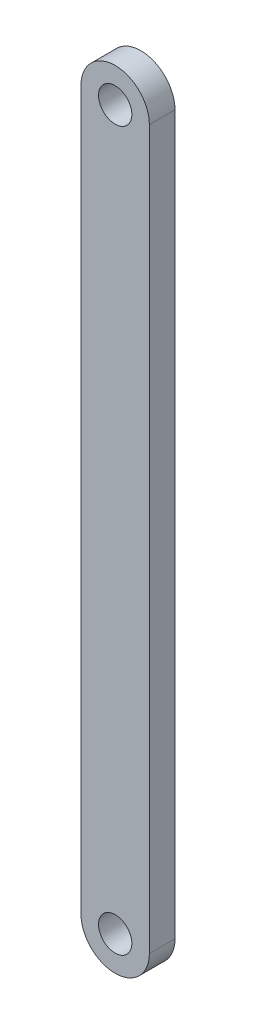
ISO-10303-21;
HEADER;
FILE_DESCRIPTION(('STEP AP214'),'2;1');
FILE_NAME('part.step','',(''),(''),'','','');
FILE_SCHEMA(('AUTOMOTIVE_DESIGN { 1 0 10303 214 1 1 1 1 }'));
ENDSEC;
DATA;
#1=APPLICATION_CONTEXT('core data for automotive mechanical design processes');
#2=APPLICATION_PROTOCOL_DEFINITION('international standard','automotive_design',2000,#1);
#3=PRODUCT_CONTEXT('',#1,'mechanical');
#4=PRODUCT('Part','Part','',(#3));
#5=PRODUCT_RELATED_PRODUCT_CATEGORY('part','',(#4));
#6=PRODUCT_DEFINITION_FORMATION('','',#4);
#7=PRODUCT_DEFINITION_CONTEXT('part definition',#1,'design');
#8=PRODUCT_DEFINITION('design','',#6,#7);
#9=PRODUCT_DEFINITION_SHAPE('','',#8);
#10=(LENGTH_UNIT() NAMED_UNIT(*) SI_UNIT(.MILLI.,.METRE.));
#11=(NAMED_UNIT(*) PLANE_ANGLE_UNIT() SI_UNIT($,.RADIAN.));
#12=(NAMED_UNIT(*) SI_UNIT($,.STERADIAN.) SOLID_ANGLE_UNIT());
#13=UNCERTAINTY_MEASURE_WITH_UNIT(LENGTH_MEASURE(1.E-05),#10,'distance_accuracy_value','');
#14=(GEOMETRIC_REPRESENTATION_CONTEXT(3) GLOBAL_UNCERTAINTY_ASSIGNED_CONTEXT((#13)) GLOBAL_UNIT_ASSIGNED_CONTEXT((#10,
#11,#12)) REPRESENTATION_CONTEXT('',''));
#15=CARTESIAN_POINT('',(0.,0.,0.));
#16=DIRECTION('',(0.,0.,1.));
#17=DIRECTION('',(1.,0.,0.));
#18=AXIS2_PLACEMENT_3D('',#15,#16,#17);
#19=CARTESIAN_POINT('',(0.,0.,3.));
#20=DIRECTION('',(0.,0.,-1.));
#21=DIRECTION('',(-1.,0.,0.));
#22=AXIS2_PLACEMENT_3D('',#19,#20,#21);
#23=CYLINDRICAL_SURFACE('',#22,4.);
#24=CARTESIAN_POINT('',(0.,0.,0.));
#25=DIRECTION('',(0.,0.,1.));
#26=DIRECTION('',(1.,0.,0.));
#27=AXIS2_PLACEMENT_3D('',#24,#25,#26);
#28=CIRCLE('',#27,4.);
#29=CARTESIAN_POINT('',(-4.,0.,0.));
#30=VERTEX_POINT('',#29);
#31=CARTESIAN_POINT('',(4.,0.,0.));
#32=VERTEX_POINT('',#31);
#33=EDGE_CURVE('E98',#30,#32,#28,.T.);
#34=ORIENTED_EDGE('',*,*,#33,.T.);
#35=DIRECTION('',(0.,0.,-1.));
#36=VECTOR('',#35,1.);
#37=CARTESIAN_POINT('',(4.,0.,3.));
#38=LINE('',#37,#36);
#39=CARTESIAN_POINT('',(4.,0.,3.));
#40=VERTEX_POINT('',#39);
#41=EDGE_CURVE('E11',#40,#32,#38,.T.);
#42=ORIENTED_EDGE('',*,*,#41,.F.);
#43=CARTESIAN_POINT('',(0.,0.,3.));
#44=DIRECTION('',(0.,0.,1.));
#45=DIRECTION('',(1.,0.,0.));
#46=AXIS2_PLACEMENT_3D('',#43,#44,#45);
#47=CIRCLE('',#46,4.);
#48=CARTESIAN_POINT('',(-4.,0.,3.));
#49=VERTEX_POINT('',#48);
#50=EDGE_CURVE('E86',#49,#40,#47,.T.);
#51=ORIENTED_EDGE('',*,*,#50,.F.);
#52=DIRECTION('',(0.,0.,-1.));
#53=VECTOR('',#52,1.);
#54=CARTESIAN_POINT('',(-4.,0.,3.));
#55=LINE('',#54,#53);
#56=EDGE_CURVE('E94',#49,#30,#55,.T.);
#57=ORIENTED_EDGE('',*,*,#56,.T.);
#58=EDGE_LOOP('',(#34,#42,#51,#57));
#59=FACE_BOUND('',#58,.T.);
#60=ADVANCED_FACE('F35',(#59),#23,.T.);
#61=CARTESIAN_POINT('',(4.,0.,3.));
#62=DIRECTION('',(-1.,0.,0.));
#63=DIRECTION('',(0.,0.,1.));
#64=AXIS2_PLACEMENT_3D('',#61,#62,#63);
#65=PLANE('',#64);
#66=DIRECTION('',(0.,1.,0.));
#67=VECTOR('',#66,1.);
#68=CARTESIAN_POINT('',(4.,0.,0.));
#69=LINE('',#68,#67);
#70=CARTESIAN_POINT('',(4.,84.,0.));
#71=VERTEX_POINT('',#70);
#72=EDGE_CURVE('E90',#32,#71,#69,.T.);
#73=ORIENTED_EDGE('',*,*,#72,.T.);
#74=DIRECTION('',(0.,0.,-1.));
#75=VECTOR('',#74,1.);
#76=CARTESIAN_POINT('',(4.,84.,3.));
#77=LINE('',#76,#75);
#78=CARTESIAN_POINT('',(4.,84.,3.));
#79=VERTEX_POINT('',#78);
#80=EDGE_CURVE('E43',#79,#71,#77,.T.);
#81=ORIENTED_EDGE('',*,*,#80,.F.);
#82=DIRECTION('',(0.,1.,0.));
#83=VECTOR('',#82,1.);
#84=CARTESIAN_POINT('',(4.,0.,3.));
#85=LINE('',#84,#83);
#86=EDGE_CURVE('E81',#40,#79,#85,.T.);
#87=ORIENTED_EDGE('',*,*,#86,.F.);
#88=ORIENTED_EDGE('',*,*,#41,.T.);
#89=EDGE_LOOP('',(#73,#81,#87,#88));
#90=FACE_BOUND('',#89,.T.);
#91=ADVANCED_FACE('F89',(#90),#65,.F.);
#92=CARTESIAN_POINT('',(0.,84.,3.));
#93=DIRECTION('',(0.,0.,-1.));
#94=DIRECTION('',(-1.,0.,0.));
#95=AXIS2_PLACEMENT_3D('',#92,#93,#94);
#96=CYLINDRICAL_SURFACE('',#95,4.);
#97=CARTESIAN_POINT('',(0.,84.,0.));
#98=DIRECTION('',(0.,0.,1.));
#99=DIRECTION('',(1.,0.,0.));
#100=AXIS2_PLACEMENT_3D('',#97,#98,#99);
#101=CIRCLE('',#100,4.);
#102=CARTESIAN_POINT('',(-4.,84.,0.));
#103=VERTEX_POINT('',#102);
#104=EDGE_CURVE('E68',#71,#103,#101,.T.);
#105=ORIENTED_EDGE('',*,*,#104,.T.);
#106=DIRECTION('',(0.,0.,-1.));
#107=VECTOR('',#106,1.);
#108=CARTESIAN_POINT('',(-4.,84.,3.));
#109=LINE('',#108,#107);
#110=CARTESIAN_POINT('',(-4.,84.,3.));
#111=VERTEX_POINT('',#110);
#112=EDGE_CURVE('E91',#111,#103,#109,.T.);
#113=ORIENTED_EDGE('',*,*,#112,.F.);
#114=CARTESIAN_POINT('',(0.,84.,3.));
#115=DIRECTION('',(0.,0.,1.));
#116=DIRECTION('',(1.,0.,0.));
#117=AXIS2_PLACEMENT_3D('',#114,#115,#116);
#118=CIRCLE('',#117,4.);
#119=EDGE_CURVE('E84',#79,#111,#118,.T.);
#120=ORIENTED_EDGE('',*,*,#119,.F.);
#121=ORIENTED_EDGE('',*,*,#80,.T.);
#122=EDGE_LOOP('',(#105,#113,#120,#121));
#123=FACE_BOUND('',#122,.T.);
#124=ADVANCED_FACE('F92',(#123),#96,.T.);
#125=CARTESIAN_POINT('',(-4.,0.,3.));
#126=DIRECTION('',(1.,0.,0.));
#127=DIRECTION('',(0.,0.,-1.));
#128=AXIS2_PLACEMENT_3D('',#125,#126,#127);
#129=PLANE('',#128);
#130=DIRECTION('',(0.,-1.,0.));
#131=VECTOR('',#130,1.);
#132=CARTESIAN_POINT('',(-4.,0.,0.));
#133=LINE('',#132,#131);
#134=EDGE_CURVE('E74',#103,#30,#133,.T.);
#135=ORIENTED_EDGE('',*,*,#134,.T.);
#136=ORIENTED_EDGE('',*,*,#56,.F.);
#137=DIRECTION('',(0.,-1.,0.));
#138=VECTOR('',#137,1.);
#139=CARTESIAN_POINT('',(-4.,0.,3.));
#140=LINE('',#139,#138);
#141=EDGE_CURVE('E51',#111,#49,#140,.T.);
#142=ORIENTED_EDGE('',*,*,#141,.F.);
#143=ORIENTED_EDGE('',*,*,#112,.T.);
#144=EDGE_LOOP('',(#135,#136,#142,#143));
#145=FACE_BOUND('',#144,.T.);
#146=ADVANCED_FACE('F106',(#145),#129,.F.);
#147=CARTESIAN_POINT('',(0.,0.,3.));
#148=DIRECTION('',(0.,0.,1.));
#149=DIRECTION('',(1.,0.,0.));
#150=AXIS2_PLACEMENT_3D('',#147,#148,#149);
#151=PLANE('',#150);
#152=CARTESIAN_POINT('',(0.,84.,3.));
#153=DIRECTION('',(0.,0.,1.));
#154=DIRECTION('',(1.,0.,0.));
#155=AXIS2_PLACEMENT_3D('',#152,#153,#154);
#156=CIRCLE('',#155,1.95);
#157=CARTESIAN_POINT('',(1.95,84.,3.));
#158=VERTEX_POINT('',#157);
#159=EDGE_CURVE('E120',#158,#158,#156,.T.);
#160=ORIENTED_EDGE('',*,*,#159,.F.);
#161=EDGE_LOOP('',(#160));
#162=FACE_BOUND('',#161,.T.);
#163=CARTESIAN_POINT('',(0.,0.,3.));
#164=DIRECTION('',(0.,0.,1.));
#165=DIRECTION('',(1.,0.,0.));
#166=AXIS2_PLACEMENT_3D('',#163,#164,#165);
#167=CIRCLE('',#166,1.95);
#168=CARTESIAN_POINT('',(1.95,0.,3.));
#169=VERTEX_POINT('',#168);
#170=EDGE_CURVE('E114',#169,#169,#167,.T.);
#171=ORIENTED_EDGE('',*,*,#170,.F.);
#172=EDGE_LOOP('',(#171));
#173=FACE_BOUND('',#172,.T.);
#174=ORIENTED_EDGE('',*,*,#50,.T.);
#175=ORIENTED_EDGE('',*,*,#86,.T.);
#176=ORIENTED_EDGE('',*,*,#119,.T.);
#177=ORIENTED_EDGE('',*,*,#141,.T.);
#178=EDGE_LOOP('',(#174,#175,#176,#177));
#179=FACE_BOUND('',#178,.T.);
#180=ADVANCED_FACE('F82',(#162,#173,#179),#151,.T.);
#181=CARTESIAN_POINT('',(0.,0.,0.));
#182=DIRECTION('',(0.,0.,1.));
#183=DIRECTION('',(1.,0.,0.));
#184=AXIS2_PLACEMENT_3D('',#181,#182,#183);
#185=PLANE('',#184);
#186=CARTESIAN_POINT('',(0.,84.,0.));
#187=DIRECTION('',(0.,0.,1.));
#188=DIRECTION('',(1.,0.,0.));
#189=AXIS2_PLACEMENT_3D('',#186,#187,#188);
#190=CIRCLE('',#189,1.95);
#191=CARTESIAN_POINT('',(1.95,84.,0.));
#192=VERTEX_POINT('',#191);
#193=EDGE_CURVE('E117',#192,#192,#190,.T.);
#194=ORIENTED_EDGE('',*,*,#193,.T.);
#195=EDGE_LOOP('',(#194));
#196=FACE_BOUND('',#195,.T.);
#197=CARTESIAN_POINT('',(0.,0.,0.));
#198=DIRECTION('',(0.,0.,1.));
#199=DIRECTION('',(1.,0.,0.));
#200=AXIS2_PLACEMENT_3D('',#197,#198,#199);
#201=CIRCLE('',#200,1.95);
#202=CARTESIAN_POINT('',(1.95,0.,0.));
#203=VERTEX_POINT('',#202);
#204=EDGE_CURVE('E101',#203,#203,#201,.T.);
#205=ORIENTED_EDGE('',*,*,#204,.T.);
#206=EDGE_LOOP('',(#205));
#207=FACE_BOUND('',#206,.T.);
#208=ORIENTED_EDGE('',*,*,#33,.F.);
#209=ORIENTED_EDGE('',*,*,#134,.F.);
#210=ORIENTED_EDGE('',*,*,#104,.F.);
#211=ORIENTED_EDGE('',*,*,#72,.F.);
#212=EDGE_LOOP('',(#208,#209,#210,#211));
#213=FACE_BOUND('',#212,.T.);
#214=ADVANCED_FACE('F109',(#196,#207,#213),#185,.F.);
#215=CARTESIAN_POINT('',(0.,0.,3.));
#216=DIRECTION('',(0.,0.,1.));
#217=DIRECTION('',(1.,0.,0.));
#218=AXIS2_PLACEMENT_3D('',#215,#216,#217);
#219=CYLINDRICAL_SURFACE('',#218,1.95);
#220=ORIENTED_EDGE('',*,*,#204,.F.);
#221=EDGE_LOOP('',(#220));
#222=FACE_BOUND('',#221,.T.);
#223=ORIENTED_EDGE('',*,*,#170,.T.);
#224=EDGE_LOOP('',(#223));
#225=FACE_BOUND('',#224,.T.);
#226=ADVANCED_FACE('F131',(#222,#225),#219,.F.);
#227=CARTESIAN_POINT('',(0.,84.,3.));
#228=DIRECTION('',(0.,0.,1.));
#229=DIRECTION('',(1.,0.,0.));
#230=AXIS2_PLACEMENT_3D('',#227,#228,#229);
#231=CYLINDRICAL_SURFACE('',#230,1.95);
#232=ORIENTED_EDGE('',*,*,#193,.F.);
#233=EDGE_LOOP('',(#232));
#234=FACE_BOUND('',#233,.T.);
#235=ORIENTED_EDGE('',*,*,#159,.T.);
#236=EDGE_LOOP('',(#235));
#237=FACE_BOUND('',#236,.T.);
#238=ADVANCED_FACE('F124',(#234,#237),#231,.F.);
#239=CLOSED_SHELL('',(#60,#91,#124,#146,#180,#214,#226,#238));
#240=MANIFOLD_SOLID_BREP('B2',#239);
#241=ADVANCED_BREP_SHAPE_REPRESENTATION('',(#18,#240),#14);
#242=SHAPE_DEFINITION_REPRESENTATION(#9,#241);
ENDSEC;
END-ISO-10303-21;
